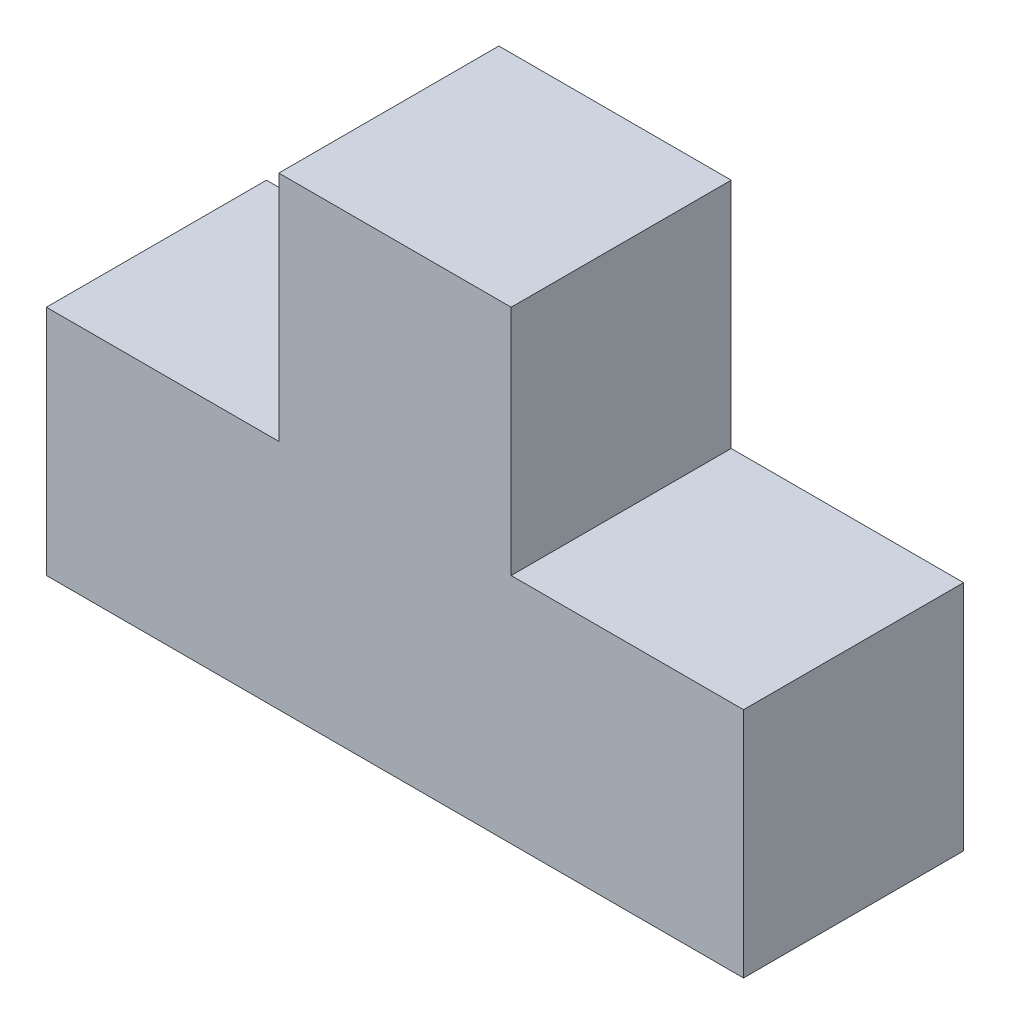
ISO-10303-21;
HEADER;
FILE_DESCRIPTION(('STEP AP214'),'2;1');
FILE_NAME('part.step','',(''),(''),'','','');
FILE_SCHEMA(('AUTOMOTIVE_DESIGN { 1 0 10303 214 1 1 1 1 }'));
ENDSEC;
DATA;
#1=APPLICATION_CONTEXT('core data for automotive mechanical design processes');
#2=APPLICATION_PROTOCOL_DEFINITION('international standard','automotive_design',2000,#1);
#3=PRODUCT_CONTEXT('',#1,'mechanical');
#4=PRODUCT('Part','Part','',(#3));
#5=PRODUCT_RELATED_PRODUCT_CATEGORY('part','',(#4));
#6=PRODUCT_DEFINITION_FORMATION('','',#4);
#7=PRODUCT_DEFINITION_CONTEXT('part definition',#1,'design');
#8=PRODUCT_DEFINITION('design','',#6,#7);
#9=PRODUCT_DEFINITION_SHAPE('','',#8);
#10=(LENGTH_UNIT() NAMED_UNIT(*) SI_UNIT(.MILLI.,.METRE.));
#11=(NAMED_UNIT(*) PLANE_ANGLE_UNIT() SI_UNIT($,.RADIAN.));
#12=(NAMED_UNIT(*) SI_UNIT($,.STERADIAN.) SOLID_ANGLE_UNIT());
#13=UNCERTAINTY_MEASURE_WITH_UNIT(LENGTH_MEASURE(1.E-05),#10,'distance_accuracy_value','');
#14=(GEOMETRIC_REPRESENTATION_CONTEXT(3) GLOBAL_UNCERTAINTY_ASSIGNED_CONTEXT((#13)) GLOBAL_UNIT_ASSIGNED_CONTEXT((#10,
#11,#12)) REPRESENTATION_CONTEXT('',''));
#15=CARTESIAN_POINT('',(0.,0.,0.));
#16=DIRECTION('',(0.,0.,1.));
#17=DIRECTION('',(1.,0.,0.));
#18=AXIS2_PLACEMENT_3D('',#15,#16,#17);
#19=CARTESIAN_POINT('',(132.515092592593,32.7128481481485,-30.48));
#20=DIRECTION('',(0.,-1.,0.));
#21=DIRECTION('',(1.,0.,0.));
#22=AXIS2_PLACEMENT_3D('',#19,#20,#21);
#23=PLANE('',#22);
#24=DIRECTION('',(1.,0.,0.));
#25=VECTOR('',#24,1.);
#26=CARTESIAN_POINT('',(132.515092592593,32.7128481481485,0.));
#27=LINE('',#26,#25);
#28=CARTESIAN_POINT('',(35.9598148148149,32.7128481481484,0.));
#29=VERTEX_POINT('',#28);
#30=CARTESIAN_POINT('',(132.515092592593,32.7128481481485,0.));
#31=VERTEX_POINT('',#30);
#32=EDGE_CURVE('E128',#29,#31,#27,.T.);
#33=ORIENTED_EDGE('',*,*,#32,.F.);
#34=DIRECTION('',(0.,0.,1.));
#35=VECTOR('',#34,1.);
#36=CARTESIAN_POINT('',(35.9598148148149,32.7128481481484,-30.48));
#37=LINE('',#36,#35);
#38=CARTESIAN_POINT('',(35.9598148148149,32.7128481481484,-30.48));
#39=VERTEX_POINT('',#38);
#40=EDGE_CURVE('E11',#39,#29,#37,.T.);
#41=ORIENTED_EDGE('',*,*,#40,.F.);
#42=DIRECTION('',(1.,0.,0.));
#43=VECTOR('',#42,1.);
#44=CARTESIAN_POINT('',(132.515092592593,32.7128481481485,-30.48));
#45=LINE('',#44,#43);
#46=CARTESIAN_POINT('',(132.515092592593,32.7128481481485,-30.48));
#47=VERTEX_POINT('',#46);
#48=EDGE_CURVE('E148',#39,#47,#45,.T.);
#49=ORIENTED_EDGE('',*,*,#48,.T.);
#50=DIRECTION('',(0.,0.,1.));
#51=VECTOR('',#50,1.);
#52=CARTESIAN_POINT('',(132.515092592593,32.7128481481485,-30.48));
#53=LINE('',#52,#51);
#54=EDGE_CURVE('E34',#47,#31,#53,.T.);
#55=ORIENTED_EDGE('',*,*,#54,.T.);
#56=EDGE_LOOP('',(#33,#41,#49,#55));
#57=FACE_BOUND('',#56,.T.);
#58=ADVANCED_FACE('F31',(#57),#23,.T.);
#59=CARTESIAN_POINT('',(35.9598148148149,32.7128481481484,-30.48));
#60=DIRECTION('',(-1.,0.,0.));
#61=DIRECTION('',(0.,0.,1.));
#62=AXIS2_PLACEMENT_3D('',#59,#60,#61);
#63=PLANE('',#62);
#64=DIRECTION('',(0.,-1.,0.));
#65=VECTOR('',#64,1.);
#66=CARTESIAN_POINT('',(35.9598148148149,32.7128481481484,0.));
#67=LINE('',#66,#65);
#68=CARTESIAN_POINT('',(35.9598148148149,64.897940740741,0.));
#69=VERTEX_POINT('',#68);
#70=EDGE_CURVE('E146',#69,#29,#67,.T.);
#71=ORIENTED_EDGE('',*,*,#70,.F.);
#72=DIRECTION('',(0.,0.,1.));
#73=VECTOR('',#72,1.);
#74=CARTESIAN_POINT('',(35.9598148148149,64.897940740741,-30.48));
#75=LINE('',#74,#73);
#76=CARTESIAN_POINT('',(35.9598148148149,64.897940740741,-30.48));
#77=VERTEX_POINT('',#76);
#78=EDGE_CURVE('E40',#77,#69,#75,.T.);
#79=ORIENTED_EDGE('',*,*,#78,.F.);
#80=DIRECTION('',(0.,-1.,0.));
#81=VECTOR('',#80,1.);
#82=CARTESIAN_POINT('',(35.9598148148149,32.7128481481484,-30.48));
#83=LINE('',#82,#81);
#84=EDGE_CURVE('E118',#77,#39,#83,.T.);
#85=ORIENTED_EDGE('',*,*,#84,.T.);
#86=ORIENTED_EDGE('',*,*,#40,.T.);
#87=EDGE_LOOP('',(#71,#79,#85,#86));
#88=FACE_BOUND('',#87,.T.);
#89=ADVANCED_FACE('F160',(#88),#63,.T.);
#90=CARTESIAN_POINT('',(35.9598148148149,64.897940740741,-30.48));
#91=DIRECTION('',(0.,1.,0.));
#92=DIRECTION('',(-1.,0.,0.));
#93=AXIS2_PLACEMENT_3D('',#90,#91,#92);
#94=PLANE('',#93);
#95=DIRECTION('',(-1.,0.,0.));
#96=VECTOR('',#95,1.);
#97=CARTESIAN_POINT('',(35.9598148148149,64.897940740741,0.));
#98=LINE('',#97,#96);
#99=CARTESIAN_POINT('',(68.1449074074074,64.897940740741,0.));
#100=VERTEX_POINT('',#99);
#101=EDGE_CURVE('E105',#100,#69,#98,.T.);
#102=ORIENTED_EDGE('',*,*,#101,.F.);
#103=DIRECTION('',(0.,0.,1.));
#104=VECTOR('',#103,1.);
#105=CARTESIAN_POINT('',(68.1449074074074,64.897940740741,-30.48));
#106=LINE('',#105,#104);
#107=CARTESIAN_POINT('',(68.1449074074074,64.897940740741,-30.48));
#108=VERTEX_POINT('',#107);
#109=EDGE_CURVE('E100',#108,#100,#106,.T.);
#110=ORIENTED_EDGE('',*,*,#109,.F.);
#111=DIRECTION('',(-1.,0.,0.));
#112=VECTOR('',#111,1.);
#113=CARTESIAN_POINT('',(35.9598148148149,64.897940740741,-30.48));
#114=LINE('',#113,#112);
#115=EDGE_CURVE('E103',#108,#77,#114,.T.);
#116=ORIENTED_EDGE('',*,*,#115,.T.);
#117=ORIENTED_EDGE('',*,*,#78,.T.);
#118=EDGE_LOOP('',(#102,#110,#116,#117));
#119=FACE_BOUND('',#118,.T.);
#120=ADVANCED_FACE('F102',(#119),#94,.T.);
#121=CARTESIAN_POINT('',(68.1449074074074,64.897940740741,-30.48));
#122=DIRECTION('',(-1.,0.,0.));
#123=DIRECTION('',(0.,0.,1.));
#124=AXIS2_PLACEMENT_3D('',#121,#122,#123);
#125=PLANE('',#124);
#126=DIRECTION('',(0.,-1.,0.));
#127=VECTOR('',#126,1.);
#128=CARTESIAN_POINT('',(68.1449074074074,64.897940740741,0.));
#129=LINE('',#128,#127);
#130=CARTESIAN_POINT('',(68.1449074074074,97.0830333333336,0.));
#131=VERTEX_POINT('',#130);
#132=EDGE_CURVE('E143',#131,#100,#129,.T.);
#133=ORIENTED_EDGE('',*,*,#132,.F.);
#134=DIRECTION('',(0.,0.,1.));
#135=VECTOR('',#134,1.);
#136=CARTESIAN_POINT('',(68.1449074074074,97.0830333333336,-30.48));
#137=LINE('',#136,#135);
#138=CARTESIAN_POINT('',(68.1449074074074,97.0830333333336,-30.48));
#139=VERTEX_POINT('',#138);
#140=EDGE_CURVE('E110',#139,#131,#137,.T.);
#141=ORIENTED_EDGE('',*,*,#140,.F.);
#142=DIRECTION('',(0.,-1.,0.));
#143=VECTOR('',#142,1.);
#144=CARTESIAN_POINT('',(68.1449074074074,64.897940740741,-30.48));
#145=LINE('',#144,#143);
#146=EDGE_CURVE('E116',#139,#108,#145,.T.);
#147=ORIENTED_EDGE('',*,*,#146,.T.);
#148=ORIENTED_EDGE('',*,*,#109,.T.);
#149=EDGE_LOOP('',(#133,#141,#147,#148));
#150=FACE_BOUND('',#149,.T.);
#151=ADVANCED_FACE('F120',(#150),#125,.T.);
#152=CARTESIAN_POINT('',(68.1449074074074,97.0830333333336,-30.48));
#153=DIRECTION('',(0.,1.,0.));
#154=DIRECTION('',(0.,0.,1.));
#155=AXIS2_PLACEMENT_3D('',#152,#153,#154);
#156=PLANE('',#155);
#157=DIRECTION('',(-1.,0.,0.));
#158=VECTOR('',#157,1.);
#159=CARTESIAN_POINT('',(68.1449074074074,97.0830333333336,0.));
#160=LINE('',#159,#158);
#161=CARTESIAN_POINT('',(100.33,97.0830333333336,0.));
#162=VERTEX_POINT('',#161);
#163=EDGE_CURVE('E140',#162,#131,#160,.T.);
#164=ORIENTED_EDGE('',*,*,#163,.F.);
#165=DIRECTION('',(0.,0.,1.));
#166=VECTOR('',#165,1.);
#167=CARTESIAN_POINT('',(100.33,97.0830333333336,-30.48));
#168=LINE('',#167,#166);
#169=CARTESIAN_POINT('',(100.33,97.0830333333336,-30.48));
#170=VERTEX_POINT('',#169);
#171=EDGE_CURVE('E152',#170,#162,#168,.T.);
#172=ORIENTED_EDGE('',*,*,#171,.F.);
#173=DIRECTION('',(-1.,0.,0.));
#174=VECTOR('',#173,1.);
#175=CARTESIAN_POINT('',(68.1449074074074,97.0830333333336,-30.48));
#176=LINE('',#175,#174);
#177=EDGE_CURVE('E121',#170,#139,#176,.T.);
#178=ORIENTED_EDGE('',*,*,#177,.T.);
#179=ORIENTED_EDGE('',*,*,#140,.T.);
#180=EDGE_LOOP('',(#164,#172,#178,#179));
#181=FACE_BOUND('',#180,.T.);
#182=ADVANCED_FACE('F173',(#181),#156,.T.);
#183=CARTESIAN_POINT('',(100.33,97.0830333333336,-30.48));
#184=DIRECTION('',(1.,0.,0.));
#185=DIRECTION('',(0.,0.,-1.));
#186=AXIS2_PLACEMENT_3D('',#183,#184,#185);
#187=PLANE('',#186);
#188=DIRECTION('',(0.,1.,0.));
#189=VECTOR('',#188,1.);
#190=CARTESIAN_POINT('',(100.33,97.0830333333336,0.));
#191=LINE('',#190,#189);
#192=CARTESIAN_POINT('',(100.33,64.897940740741,0.));
#193=VERTEX_POINT('',#192);
#194=EDGE_CURVE('E137',#193,#162,#191,.T.);
#195=ORIENTED_EDGE('',*,*,#194,.F.);
#196=DIRECTION('',(0.,0.,1.));
#197=VECTOR('',#196,1.);
#198=CARTESIAN_POINT('',(100.33,64.897940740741,-30.48));
#199=LINE('',#198,#197);
#200=CARTESIAN_POINT('',(100.33,64.897940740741,-30.48));
#201=VERTEX_POINT('',#200);
#202=EDGE_CURVE('E154',#201,#193,#199,.T.);
#203=ORIENTED_EDGE('',*,*,#202,.F.);
#204=DIRECTION('',(0.,1.,0.));
#205=VECTOR('',#204,1.);
#206=CARTESIAN_POINT('',(100.33,97.0830333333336,-30.48));
#207=LINE('',#206,#205);
#208=EDGE_CURVE('E123',#201,#170,#207,.T.);
#209=ORIENTED_EDGE('',*,*,#208,.T.);
#210=ORIENTED_EDGE('',*,*,#171,.T.);
#211=EDGE_LOOP('',(#195,#203,#209,#210));
#212=FACE_BOUND('',#211,.T.);
#213=ADVANCED_FACE('F176',(#212),#187,.T.);
#214=CARTESIAN_POINT('',(100.33,64.897940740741,-30.48));
#215=DIRECTION('',(0.,1.,0.));
#216=DIRECTION('',(-1.,0.,0.));
#217=AXIS2_PLACEMENT_3D('',#214,#215,#216);
#218=PLANE('',#217);
#219=DIRECTION('',(-1.,0.,0.));
#220=VECTOR('',#219,1.);
#221=CARTESIAN_POINT('',(100.33,64.897940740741,0.));
#222=LINE('',#221,#220);
#223=CARTESIAN_POINT('',(132.515092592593,64.897940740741,0.));
#224=VERTEX_POINT('',#223);
#225=EDGE_CURVE('E134',#224,#193,#222,.T.);
#226=ORIENTED_EDGE('',*,*,#225,.F.);
#227=DIRECTION('',(0.,0.,1.));
#228=VECTOR('',#227,1.);
#229=CARTESIAN_POINT('',(132.515092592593,64.897940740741,-30.48));
#230=LINE('',#229,#228);
#231=CARTESIAN_POINT('',(132.515092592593,64.897940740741,-30.48));
#232=VERTEX_POINT('',#231);
#233=EDGE_CURVE('E155',#232,#224,#230,.T.);
#234=ORIENTED_EDGE('',*,*,#233,.F.);
#235=DIRECTION('',(-1.,0.,0.));
#236=VECTOR('',#235,1.);
#237=CARTESIAN_POINT('',(100.33,64.897940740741,-30.48));
#238=LINE('',#237,#236);
#239=EDGE_CURVE('E251',#232,#201,#238,.T.);
#240=ORIENTED_EDGE('',*,*,#239,.T.);
#241=ORIENTED_EDGE('',*,*,#202,.T.);
#242=EDGE_LOOP('',(#226,#234,#240,#241));
#243=FACE_BOUND('',#242,.T.);
#244=ADVANCED_FACE('F180',(#243),#218,.T.);
#245=CARTESIAN_POINT('',(132.515092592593,64.897940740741,-30.48));
#246=DIRECTION('',(1.,0.,0.));
#247=DIRECTION('',(0.,0.,-1.));
#248=AXIS2_PLACEMENT_3D('',#245,#246,#247);
#249=PLANE('',#248);
#250=DIRECTION('',(0.,1.,0.));
#251=VECTOR('',#250,1.);
#252=CARTESIAN_POINT('',(132.515092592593,64.897940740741,0.));
#253=LINE('',#252,#251);
#254=EDGE_CURVE('E131',#31,#224,#253,.T.);
#255=ORIENTED_EDGE('',*,*,#254,.F.);
#256=ORIENTED_EDGE('',*,*,#54,.F.);
#257=DIRECTION('',(0.,1.,0.));
#258=VECTOR('',#257,1.);
#259=CARTESIAN_POINT('',(132.515092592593,64.897940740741,-30.48));
#260=LINE('',#259,#258);
#261=EDGE_CURVE('E252',#47,#232,#260,.T.);
#262=ORIENTED_EDGE('',*,*,#261,.T.);
#263=ORIENTED_EDGE('',*,*,#233,.T.);
#264=EDGE_LOOP('',(#255,#256,#262,#263));
#265=FACE_BOUND('',#264,.T.);
#266=ADVANCED_FACE('F157',(#265),#249,.T.);
#267=CARTESIAN_POINT('',(35.9598148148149,32.7128481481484,-30.48));
#268=DIRECTION('',(0.,0.,-1.));
#269=DIRECTION('',(-1.,0.,0.));
#270=AXIS2_PLACEMENT_3D('',#267,#268,#269);
#271=PLANE('',#270);
#272=ORIENTED_EDGE('',*,*,#48,.F.);
#273=ORIENTED_EDGE('',*,*,#84,.F.);
#274=ORIENTED_EDGE('',*,*,#115,.F.);
#275=ORIENTED_EDGE('',*,*,#146,.F.);
#276=ORIENTED_EDGE('',*,*,#177,.F.);
#277=ORIENTED_EDGE('',*,*,#208,.F.);
#278=ORIENTED_EDGE('',*,*,#239,.F.);
#279=ORIENTED_EDGE('',*,*,#261,.F.);
#280=EDGE_LOOP('',(#272,#273,#274,#275,#276,#277,#278,#279));
#281=FACE_BOUND('',#280,.T.);
#282=ADVANCED_FACE('F114',(#281),#271,.T.);
#283=CARTESIAN_POINT('',(35.9598148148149,32.7128481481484,0.));
#284=DIRECTION('',(0.,0.,-1.));
#285=DIRECTION('',(-1.,0.,0.));
#286=AXIS2_PLACEMENT_3D('',#283,#284,#285);
#287=PLANE('',#286);
#288=ORIENTED_EDGE('',*,*,#32,.T.);
#289=ORIENTED_EDGE('',*,*,#254,.T.);
#290=ORIENTED_EDGE('',*,*,#225,.T.);
#291=ORIENTED_EDGE('',*,*,#194,.T.);
#292=ORIENTED_EDGE('',*,*,#163,.T.);
#293=ORIENTED_EDGE('',*,*,#132,.T.);
#294=ORIENTED_EDGE('',*,*,#101,.T.);
#295=ORIENTED_EDGE('',*,*,#70,.T.);
#296=EDGE_LOOP('',(#288,#289,#290,#291,#292,#293,#294,#295));
#297=FACE_BOUND('',#296,.T.);
#298=ADVANCED_FACE('F159',(#297),#287,.F.);
#299=CLOSED_SHELL('',(#58,#89,#120,#151,#182,#213,#244,#266,#282,#298));
#300=MANIFOLD_SOLID_BREP('B2',#299);
#301=ADVANCED_BREP_SHAPE_REPRESENTATION('',(#18,#300),#14);
#302=SHAPE_DEFINITION_REPRESENTATION(#9,#301);
ENDSEC;
END-ISO-10303-21;
